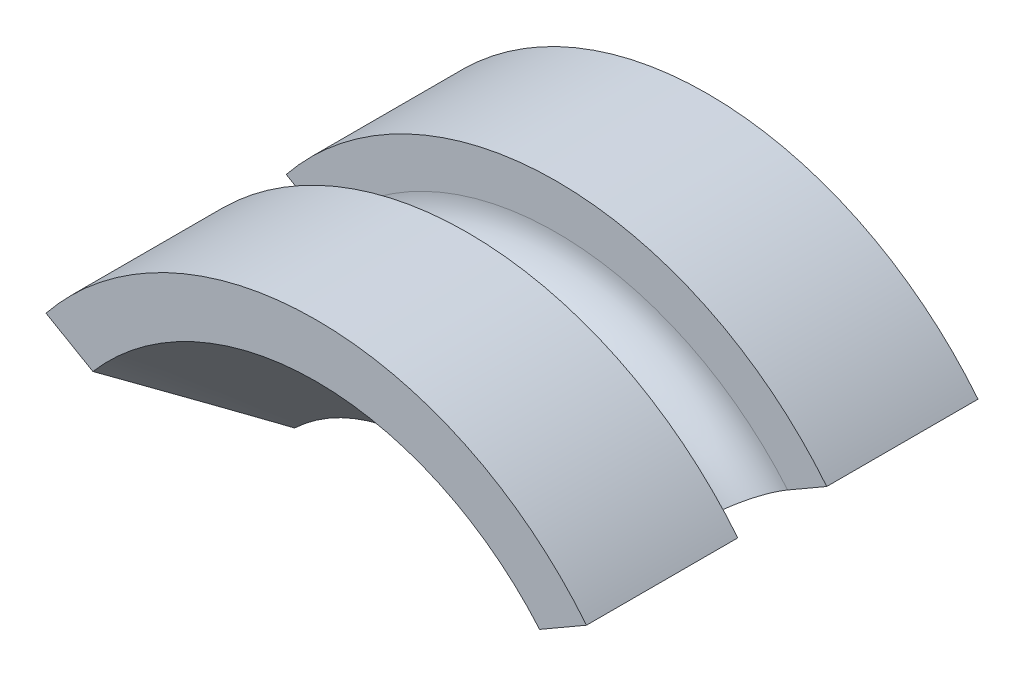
ISO-10303-21;
HEADER;
FILE_DESCRIPTION(('STEP AP214'),'2;1');
FILE_NAME('part.step','',(''),(''),'','','');
FILE_SCHEMA(('AUTOMOTIVE_DESIGN { 1 0 10303 214 1 1 1 1 }'));
ENDSEC;
DATA;
#1=APPLICATION_CONTEXT('core data for automotive mechanical design processes');
#2=APPLICATION_PROTOCOL_DEFINITION('international standard','automotive_design',2000,#1);
#3=PRODUCT_CONTEXT('',#1,'mechanical');
#4=PRODUCT('Part','Part','',(#3));
#5=PRODUCT_RELATED_PRODUCT_CATEGORY('part','',(#4));
#6=PRODUCT_DEFINITION_FORMATION('','',#4);
#7=PRODUCT_DEFINITION_CONTEXT('part definition',#1,'design');
#8=PRODUCT_DEFINITION('design','',#6,#7);
#9=PRODUCT_DEFINITION_SHAPE('','',#8);
#10=(LENGTH_UNIT() NAMED_UNIT(*) SI_UNIT(.MILLI.,.METRE.));
#11=(NAMED_UNIT(*) PLANE_ANGLE_UNIT() SI_UNIT($,.RADIAN.));
#12=(NAMED_UNIT(*) SI_UNIT($,.STERADIAN.) SOLID_ANGLE_UNIT());
#13=UNCERTAINTY_MEASURE_WITH_UNIT(LENGTH_MEASURE(1.E-05),#10,'distance_accuracy_value','');
#14=(GEOMETRIC_REPRESENTATION_CONTEXT(3) GLOBAL_UNCERTAINTY_ASSIGNED_CONTEXT((#13)) GLOBAL_UNIT_ASSIGNED_CONTEXT((#10,
#11,#12)) REPRESENTATION_CONTEXT('',''));
#15=CARTESIAN_POINT('',(0.,0.,0.));
#16=DIRECTION('',(0.,0.,1.));
#17=DIRECTION('',(1.,0.,0.));
#18=AXIS2_PLACEMENT_3D('',#15,#16,#17);
#19=CARTESIAN_POINT('',(0.,0.,0.));
#20=DIRECTION('',(0.,0.,-1.));
#21=DIRECTION('',(0.,1.,0.));
#22=AXIS2_PLACEMENT_3D('',#19,#20,#21);
#23=CYLINDRICAL_SURFACE('',#22,3.9);
#24=CARTESIAN_POINT('',(0.,0.,2.7));
#25=DIRECTION('',(0.,0.,-1.));
#26=DIRECTION('',(0.,1.,0.));
#27=AXIS2_PLACEMENT_3D('',#24,#25,#26);
#28=CIRCLE('',#27,3.9);
#29=CARTESIAN_POINT('',(-3.03728931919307,2.44640012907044,2.7));
#30=VERTEX_POINT('',#29);
#31=CARTESIAN_POINT('',(3.03728931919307,2.44640012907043,2.7));
#32=VERTEX_POINT('',#31);
#33=EDGE_CURVE('E109',#30,#32,#28,.T.);
#34=ORIENTED_EDGE('',*,*,#33,.F.);
#35=DIRECTION('',(0.,0.,-1.));
#36=VECTOR('',#35,1.);
#37=CARTESIAN_POINT('',(-3.03728931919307,2.44640012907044,4.4));
#38=LINE('',#37,#36);
#39=CARTESIAN_POINT('',(-3.03728931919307,2.44640012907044,4.4));
#40=VERTEX_POINT('',#39);
#41=EDGE_CURVE('E92',#40,#30,#38,.T.);
#42=ORIENTED_EDGE('',*,*,#41,.F.);
#43=CARTESIAN_POINT('',(0.,0.,4.4));
#44=DIRECTION('',(0.,0.,-1.));
#45=DIRECTION('',(0.,1.,0.));
#46=AXIS2_PLACEMENT_3D('',#43,#44,#45);
#47=CIRCLE('',#46,3.9);
#48=CARTESIAN_POINT('',(3.03728931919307,2.44640012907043,4.4));
#49=VERTEX_POINT('',#48);
#50=EDGE_CURVE('E107',#40,#49,#47,.T.);
#51=ORIENTED_EDGE('',*,*,#50,.T.);
#52=DIRECTION('',(0.,0.,-1.));
#53=VECTOR('',#52,1.);
#54=CARTESIAN_POINT('',(3.03728931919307,2.44640012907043,4.4));
#55=LINE('',#54,#53);
#56=EDGE_CURVE('E248',#49,#32,#55,.T.);
#57=ORIENTED_EDGE('',*,*,#56,.T.);
#58=EDGE_LOOP('',(#34,#42,#51,#57));
#59=FACE_BOUND('',#58,.T.);
#60=ADVANCED_FACE('F14',(#59),#23,.T.);
#61=CARTESIAN_POINT('',(0.,0.,4.4));
#62=DIRECTION('',(0.,0.,1.));
#63=DIRECTION('',(0.,-1.,0.));
#64=AXIS2_PLACEMENT_3D('',#61,#62,#63);
#65=CONICAL_SURFACE('',#64,3.3,0.785398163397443);
#66=CARTESIAN_POINT('',(0.,0.,4.4));
#67=DIRECTION('',(0.,0.,-1.));
#68=DIRECTION('',(0.,1.,0.));
#69=AXIS2_PLACEMENT_3D('',#66,#67,#68);
#70=CIRCLE('',#69,3.3);
#71=CARTESIAN_POINT('',(-2.51024909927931,2.14211331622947,4.4));
#72=VERTEX_POINT('',#71);
#73=CARTESIAN_POINT('',(2.51024909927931,2.14211331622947,4.4));
#74=VERTEX_POINT('',#73);
#75=EDGE_CURVE('E116',#72,#74,#70,.T.);
#76=ORIENTED_EDGE('',*,*,#75,.F.);
#77=CARTESIAN_POINT('',(-2.51042524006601,2.14221501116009,4.4002));
#78=CARTESIAN_POINT('',(-2.4218729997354,2.09108935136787,4.29965995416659));
#79=CARTESIAN_POINT('',(-2.33325892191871,2.03992798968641,4.1991923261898));
#80=CARTESIAN_POINT('',(-2.15584779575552,1.93749962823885,3.99847468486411));
#81=CARTESIAN_POINT('',(-2.0670507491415,1.88623262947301,3.89822466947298));
#82=CARTESIAN_POINT('',(-1.88921221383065,1.783557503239,3.69801256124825));
#83=CARTESIAN_POINT('',(-1.80017072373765,1.73214937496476,3.59805047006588));
#84=CARTESIAN_POINT('',(-1.62172129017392,1.62912154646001,3.39856157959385));
#85=CARTESIAN_POINT('',(-1.53231334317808,1.57750184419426,3.29903478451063));
#86=CARTESIAN_POINT('',(-1.44266176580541,1.52574148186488,3.1998));
#87=B_SPLINE_CURVE_WITH_KNOTS('',3,(#77,#78,#79,#80,#81,#82,#83,#84,#85,#86),.UNSPECIFIED.,.F.,
.F.,(4,2,2,2,4),(0.,0.43020090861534,0.8603977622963,1.29059707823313,1.72080054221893),.UNSPECIFIED.);
#88=CARTESIAN_POINT('',(-1.44284250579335,1.52584583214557,3.2));
#89=VERTEX_POINT('',#88);
#90=EDGE_CURVE('E95',#72,#89,#87,.T.);
#91=ORIENTED_EDGE('',*,*,#90,.T.);
#92=CARTESIAN_POINT('',(0.,0.,3.2));
#93=DIRECTION('',(0.,0.,-1.));
#94=DIRECTION('',(0.,1.,0.));
#95=AXIS2_PLACEMENT_3D('',#92,#93,#94);
#96=CIRCLE('',#95,2.1);
#97=CARTESIAN_POINT('',(1.44284250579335,1.52584583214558,3.2));
#98=VERTEX_POINT('',#97);
#99=EDGE_CURVE('E130',#89,#98,#96,.T.);
#100=ORIENTED_EDGE('',*,*,#99,.T.);
#101=CARTESIAN_POINT('',(1.44266176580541,1.52574148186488,3.1998));
#102=CARTESIAN_POINT('',(1.53231334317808,1.57750184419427,3.29903478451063));
#103=CARTESIAN_POINT('',(1.62172129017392,1.62912154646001,3.39856157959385));
#104=CARTESIAN_POINT('',(1.80017072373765,1.73214937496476,3.59805047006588));
#105=CARTESIAN_POINT('',(1.88921221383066,1.78355750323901,3.69801256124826));
#106=CARTESIAN_POINT('',(2.06705074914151,1.88623262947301,3.89822466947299));
#107=CARTESIAN_POINT('',(2.15584779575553,1.93749962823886,3.99847468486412));
#108=CARTESIAN_POINT('',(2.33325892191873,2.03992798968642,4.19919232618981));
#109=CARTESIAN_POINT('',(2.42187299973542,2.09108935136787,4.2996599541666));
#110=CARTESIAN_POINT('',(2.51042524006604,2.1422150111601,4.4002));
#111=B_SPLINE_CURVE_WITH_KNOTS('',3,(#101,#102,#103,#104,#105,#106,#107,#108,#109,#110),
.UNSPECIFIED.,.F.,.F.,(4,2,2,2,4),(0.,0.430203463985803,0.86040277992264,1.29059963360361,
1.72080054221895),.UNSPECIFIED.);
#112=EDGE_CURVE('E181',#98,#74,#111,.T.);
#113=ORIENTED_EDGE('',*,*,#112,.T.);
#114=EDGE_LOOP('',(#76,#91,#100,#113));
#115=FACE_BOUND('',#114,.T.);
#116=ADVANCED_FACE('F16',(#115),#65,.F.);
#117=CARTESIAN_POINT('',(0.,0.,0.));
#118=DIRECTION('',(0.,0.,-1.));
#119=DIRECTION('',(0.,1.,0.));
#120=AXIS2_PLACEMENT_3D('',#117,#118,#119);
#121=CYLINDRICAL_SURFACE('',#120,2.1);
#122=ORIENTED_EDGE('',*,*,#99,.F.);
#123=DIRECTION('',(0.,0.,-1.));
#124=VECTOR('',#123,1.);
#125=CARTESIAN_POINT('',(-1.44284250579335,1.52584583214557,4.4));
#126=LINE('',#125,#124);
#127=CARTESIAN_POINT('',(-1.44284250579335,1.52584583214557,1.20000000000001));
#128=VERTEX_POINT('',#127);
#129=EDGE_CURVE('E110',#89,#128,#126,.T.);
#130=ORIENTED_EDGE('',*,*,#129,.T.);
#131=CARTESIAN_POINT('',(0.,0.,1.20000000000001));
#132=DIRECTION('',(0.,0.,-1.));
#133=DIRECTION('',(0.,1.,0.));
#134=AXIS2_PLACEMENT_3D('',#131,#132,#133);
#135=CIRCLE('',#134,2.1);
#136=CARTESIAN_POINT('',(1.44284250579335,1.52584583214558,1.20000000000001));
#137=VERTEX_POINT('',#136);
#138=EDGE_CURVE('E127',#128,#137,#135,.T.);
#139=ORIENTED_EDGE('',*,*,#138,.T.);
#140=DIRECTION('',(0.,0.,-1.));
#141=VECTOR('',#140,1.);
#142=CARTESIAN_POINT('',(1.44284250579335,1.52584583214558,4.4));
#143=LINE('',#142,#141);
#144=EDGE_CURVE('E246',#98,#137,#143,.T.);
#145=ORIENTED_EDGE('',*,*,#144,.F.);
#146=EDGE_LOOP('',(#122,#130,#139,#145));
#147=FACE_BOUND('',#146,.T.);
#148=ADVANCED_FACE('F209',(#147),#121,.F.);
#149=CARTESIAN_POINT('',(0.,0.,1.20000000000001));
#150=DIRECTION('',(0.,0.,-1.));
#151=DIRECTION('',(0.,1.,0.));
#152=AXIS2_PLACEMENT_3D('',#149,#150,#151);
#153=CONICAL_SURFACE('',#152,2.1,0.785398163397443);
#154=ORIENTED_EDGE('',*,*,#138,.F.);
#155=CARTESIAN_POINT('',(-1.44266176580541,1.52574148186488,1.20020000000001));
#156=CARTESIAN_POINT('',(-1.53231334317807,1.57750184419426,1.10096521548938));
#157=CARTESIAN_POINT('',(-1.62172129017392,1.62912154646,1.00143842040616));
#158=CARTESIAN_POINT('',(-1.80017072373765,1.73214937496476,0.801949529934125));
#159=CARTESIAN_POINT('',(-1.88921221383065,1.783557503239,0.701987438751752));
#160=CARTESIAN_POINT('',(-2.0670507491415,1.88623262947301,0.501775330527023));
#161=CARTESIAN_POINT('',(-2.15584779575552,1.93749962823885,0.40152531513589));
#162=CARTESIAN_POINT('',(-2.33325892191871,2.03992798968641,0.200807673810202));
#163=CARTESIAN_POINT('',(-2.4218729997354,2.09108935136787,0.100340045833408));
#164=CARTESIAN_POINT('',(-2.51042524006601,2.14221501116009,-0.000199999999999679));
#165=B_SPLINE_CURVE_WITH_KNOTS('',3,(#155,#156,#157,#158,#159,#160,#161,#162,#163,#164),
.UNSPECIFIED.,.F.,.F.,(4,2,2,2,4),(0.,0.430203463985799,0.860402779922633,1.2905996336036,
1.72080054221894),.UNSPECIFIED.);
#166=CARTESIAN_POINT('',(-2.51024909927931,2.14211331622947,0.));
#167=VERTEX_POINT('',#166);
#168=EDGE_CURVE('E160',#128,#167,#165,.T.);
#169=ORIENTED_EDGE('',*,*,#168,.T.);
#170=CARTESIAN_POINT('',(0.,0.,0.));
#171=DIRECTION('',(0.,0.,-1.));
#172=DIRECTION('',(0.,1.,0.));
#173=AXIS2_PLACEMENT_3D('',#170,#171,#172);
#174=CIRCLE('',#173,3.3);
#175=CARTESIAN_POINT('',(2.51024909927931,2.14211331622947,0.));
#176=VERTEX_POINT('',#175);
#177=EDGE_CURVE('E119',#167,#176,#174,.T.);
#178=ORIENTED_EDGE('',*,*,#177,.T.);
#179=CARTESIAN_POINT('',(2.51042524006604,2.1422150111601,-0.000200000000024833));
#180=CARTESIAN_POINT('',(2.42187299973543,2.09108935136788,0.100340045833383));
#181=CARTESIAN_POINT('',(2.33325892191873,2.03992798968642,0.200807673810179));
#182=CARTESIAN_POINT('',(2.15584779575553,1.93749962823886,0.40152531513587));
#183=CARTESIAN_POINT('',(2.06705074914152,1.88623262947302,0.501775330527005));
#184=CARTESIAN_POINT('',(1.88921221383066,1.78355750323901,0.701987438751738));
#185=CARTESIAN_POINT('',(1.80017072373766,1.73214937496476,0.801949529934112));
#186=CARTESIAN_POINT('',(1.62172129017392,1.62912154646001,1.00143842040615));
#187=CARTESIAN_POINT('',(1.53231334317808,1.57750184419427,1.10096521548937));
#188=CARTESIAN_POINT('',(1.44266176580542,1.52574148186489,1.20020000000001));
#189=B_SPLINE_CURVE_WITH_KNOTS('',3,(#179,#180,#181,#182,#183,#184,#185,#186,#187,#188),
.UNSPECIFIED.,.F.,.F.,(4,2,2,2,4),(0.,0.430200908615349,0.860397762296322,1.29059707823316,
1.72080054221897),.UNSPECIFIED.);
#190=EDGE_CURVE('E198',#176,#137,#189,.T.);
#191=ORIENTED_EDGE('',*,*,#190,.T.);
#192=EDGE_LOOP('',(#154,#169,#178,#191));
#193=FACE_BOUND('',#192,.T.);
#194=ADVANCED_FACE('F204',(#193),#153,.F.);
#195=CARTESIAN_POINT('',(3.3,0.,0.));
#196=DIRECTION('',(0.,0.,-1.));
#197=DIRECTION('',(0.,1.,0.));
#198=AXIS2_PLACEMENT_3D('',#195,#196,#197);
#199=PLANE('',#198);
#200=ORIENTED_EDGE('',*,*,#177,.F.);
#201=DIRECTION('',(-0.86602540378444,0.5,0.));
#202=VECTOR('',#201,1.);
#203=CARTESIAN_POINT('',(-1.44284250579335,1.52584583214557,0.));
#204=LINE('',#203,#202);
#205=CARTESIAN_POINT('',(-3.03728931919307,2.44640012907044,0.));
#206=VERTEX_POINT('',#205);
#207=EDGE_CURVE('E240',#167,#206,#204,.T.);
#208=ORIENTED_EDGE('',*,*,#207,.T.);
#209=CARTESIAN_POINT('',(0.,0.,0.));
#210=DIRECTION('',(0.,0.,-1.));
#211=DIRECTION('',(0.,1.,0.));
#212=AXIS2_PLACEMENT_3D('',#209,#210,#211);
#213=CIRCLE('',#212,3.9);
#214=CARTESIAN_POINT('',(3.03728931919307,2.44640012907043,0.));
#215=VERTEX_POINT('',#214);
#216=EDGE_CURVE('E115',#206,#215,#213,.T.);
#217=ORIENTED_EDGE('',*,*,#216,.T.);
#218=DIRECTION('',(-0.866025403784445,-0.5,0.));
#219=VECTOR('',#218,1.);
#220=CARTESIAN_POINT('',(1.44284250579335,1.52584583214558,0.));
#221=LINE('',#220,#219);
#222=EDGE_CURVE('E101',#215,#176,#221,.T.);
#223=ORIENTED_EDGE('',*,*,#222,.T.);
#224=EDGE_LOOP('',(#200,#208,#217,#223));
#225=FACE_BOUND('',#224,.T.);
#226=ADVANCED_FACE('F208',(#225),#199,.T.);
#227=ORIENTED_EDGE('',*,*,#216,.F.);
#228=CARTESIAN_POINT('',(-3.03728931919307,2.44640012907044,1.7));
#229=VERTEX_POINT('',#228);
#230=EDGE_CURVE('E111',#229,#206,#38,.T.);
#231=ORIENTED_EDGE('',*,*,#230,.F.);
#232=CARTESIAN_POINT('',(0.,0.,1.7));
#233=DIRECTION('',(0.,0.,-1.));
#234=DIRECTION('',(0.,1.,0.));
#235=AXIS2_PLACEMENT_3D('',#232,#233,#234);
#236=CIRCLE('',#235,3.9);
#237=CARTESIAN_POINT('',(3.03728931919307,2.44640012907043,1.7));
#238=VERTEX_POINT('',#237);
#239=EDGE_CURVE('E149',#229,#238,#236,.T.);
#240=ORIENTED_EDGE('',*,*,#239,.T.);
#241=EDGE_CURVE('E37',#238,#215,#55,.T.);
#242=ORIENTED_EDGE('',*,*,#241,.T.);
#243=EDGE_LOOP('',(#227,#231,#240,#242));
#244=FACE_BOUND('',#243,.T.);
#245=ADVANCED_FACE('F223',(#244),#23,.T.);
#246=CARTESIAN_POINT('',(3.9,0.,4.4));
#247=DIRECTION('',(0.,0.,1.));
#248=DIRECTION('',(0.,-1.,0.));
#249=AXIS2_PLACEMENT_3D('',#246,#247,#248);
#250=PLANE('',#249);
#251=ORIENTED_EDGE('',*,*,#50,.F.);
#252=DIRECTION('',(-0.86602540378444,0.5,0.));
#253=VECTOR('',#252,1.);
#254=CARTESIAN_POINT('',(-1.44284250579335,1.52584583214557,4.4));
#255=LINE('',#254,#253);
#256=EDGE_CURVE('E89',#72,#40,#255,.T.);
#257=ORIENTED_EDGE('',*,*,#256,.F.);
#258=ORIENTED_EDGE('',*,*,#75,.T.);
#259=DIRECTION('',(-0.866025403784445,-0.5,0.));
#260=VECTOR('',#259,1.);
#261=CARTESIAN_POINT('',(1.44284250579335,1.52584583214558,4.4));
#262=LINE('',#261,#260);
#263=EDGE_CURVE('E100',#49,#74,#262,.T.);
#264=ORIENTED_EDGE('',*,*,#263,.F.);
#265=EDGE_LOOP('',(#251,#257,#258,#264));
#266=FACE_BOUND('',#265,.T.);
#267=ADVANCED_FACE('F114',(#266),#250,.T.);
#268=CARTESIAN_POINT('',(3.9,0.,2.7));
#269=DIRECTION('',(0.,0.,1.));
#270=DIRECTION('',(0.,-1.,0.));
#271=AXIS2_PLACEMENT_3D('',#268,#269,#270);
#272=PLANE('',#271);
#273=DIRECTION('',(0.86602540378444,-0.5,0.));
#274=VECTOR('',#273,1.);
#275=CARTESIAN_POINT('',(3.225,-1.169134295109,2.7));
#276=LINE('',#275,#274);
#277=CARTESIAN_POINT('',(-2.59827534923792,2.19293529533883,2.7));
#278=VERTEX_POINT('',#277);
#279=EDGE_CURVE('E180',#30,#278,#276,.T.);
#280=ORIENTED_EDGE('',*,*,#279,.F.);
#281=ORIENTED_EDGE('',*,*,#33,.T.);
#282=DIRECTION('',(0.866025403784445,0.5,0.));
#283=VECTOR('',#282,1.);
#284=CARTESIAN_POINT('',(2.625,2.20836477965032,2.7));
#285=LINE('',#284,#283);
#286=CARTESIAN_POINT('',(2.59827534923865,2.19293529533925,2.70000000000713));
#287=VERTEX_POINT('',#286);
#288=EDGE_CURVE('E146',#287,#32,#285,.T.);
#289=ORIENTED_EDGE('',*,*,#288,.F.);
#290=CARTESIAN_POINT('',(0.,0.,2.7));
#291=DIRECTION('',(0.,0.,-1.));
#292=DIRECTION('',(0.,1.,0.));
#293=AXIS2_PLACEMENT_3D('',#290,#291,#292);
#294=CIRCLE('',#293,3.4);
#295=EDGE_CURVE('E121',#278,#287,#294,.T.);
#296=ORIENTED_EDGE('',*,*,#295,.F.);
#297=EDGE_LOOP('',(#280,#281,#289,#296));
#298=FACE_BOUND('',#297,.T.);
#299=ADVANCED_FACE('F190',(#298),#272,.F.);
#300=CARTESIAN_POINT('',(0.,0.,2.2));
#301=DIRECTION('',(0.,0.,-1.));
#302=DIRECTION('',(0.,1.,0.));
#303=AXIS2_PLACEMENT_3D('',#300,#301,#302);
#304=TOROIDAL_SURFACE('',#303,3.4,0.5);
#305=CARTESIAN_POINT('',(-2.81541194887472,2.31829916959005,1.76530383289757));
#306=CARTESIAN_POINT('',(-2.83675637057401,2.33062237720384,1.77912218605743));
#307=CARTESIAN_POINT('',(-2.85711463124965,2.34237622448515,1.79501022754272));
#308=CARTESIAN_POINT('',(-2.89525736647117,2.36439794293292,1.83050909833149));
#309=CARTESIAN_POINT('',(-2.91303911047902,2.37466423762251,1.85012382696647));
#310=CARTESIAN_POINT('',(-2.94548969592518,2.39339959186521,1.89253678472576));
#311=CARTESIAN_POINT('',(-2.96015833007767,2.40186853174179,1.91533522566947));
#312=CARTESIAN_POINT('',(-2.98593371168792,2.41674995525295,1.96346841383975));
#313=CARTESIAN_POINT('',(-2.99704133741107,2.42316294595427,1.98880253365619));
#314=CARTESIAN_POINT('',(-3.01528006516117,2.43369308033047,2.04105565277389));
#315=CARTESIAN_POINT('',(-3.02244498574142,2.43782974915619,2.06795891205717));
#316=CARTESIAN_POINT('',(-3.03272767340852,2.44376646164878,2.12277830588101));
#317=CARTESIAN_POINT('',(-3.03584549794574,2.44556653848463,2.15069442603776));
#318=CARTESIAN_POINT('',(-3.03793041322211,2.44677026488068,2.20651593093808));
#319=CARTESIAN_POINT('',(-3.03692934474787,2.4461922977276,2.23441973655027));
#320=CARTESIAN_POINT('',(-3.03087886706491,2.44269905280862,2.28963520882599));
#321=CARTESIAN_POINT('',(-3.02582953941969,2.43978382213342,2.31694688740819));
#322=CARTESIAN_POINT('',(-3.01184290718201,2.43170863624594,2.3701734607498));
#323=CARTESIAN_POINT('',(-3.00291009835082,2.42655127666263,2.39608993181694));
#324=CARTESIAN_POINT('',(-2.98142346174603,2.41414596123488,2.44583659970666));
#325=CARTESIAN_POINT('',(-2.96886957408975,2.40689797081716,2.46966676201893));
#326=CARTESIAN_POINT('',(-2.94042912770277,2.39047787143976,2.51471360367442));
#327=CARTESIAN_POINT('',(-2.92452427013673,2.38129519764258,2.53591487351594));
#328=CARTESIAN_POINT('',(-2.88988777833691,2.36129780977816,2.57497401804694));
#329=CARTESIAN_POINT('',(-2.871156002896,2.35048301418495,2.59283172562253));
#330=CARTESIAN_POINT('',(-2.83118135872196,2.32740364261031,2.6249092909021));
#331=CARTESIAN_POINT('',(-2.80991328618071,2.31512451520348,2.63908726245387));
#332=CARTESIAN_POINT('',(-2.76563789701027,2.28956210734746,2.66318046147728));
#333=CARTESIAN_POINT('',(-2.7426304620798,2.27627875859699,2.673095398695));
#334=CARTESIAN_POINT('',(-2.69520548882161,2.24889793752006,2.6885173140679));
#335=CARTESIAN_POINT('',(-2.67077336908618,2.23479204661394,2.69396451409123));
#336=CARTESIAN_POINT('',(-2.62146487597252,2.20632377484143,2.70010090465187));
#337=CARTESIAN_POINT('',(-2.59658847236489,2.1919613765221,2.70078977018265));
#338=CARTESIAN_POINT('',(-2.5468118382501,2.16322282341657,2.69738447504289));
#339=CARTESIAN_POINT('',(-2.52191425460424,2.14884819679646,2.69323855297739));
#340=CARTESIAN_POINT('',(-2.47306971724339,2.12064779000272,2.68019538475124));
#341=CARTESIAN_POINT('',(-2.44912280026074,2.10682203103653,2.67129795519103));
#342=CARTESIAN_POINT('',(-2.40278886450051,2.08007112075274,2.64895478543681));
#343=CARTESIAN_POINT('',(-2.3804068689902,2.06714886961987,2.63549514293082));
#344=CARTESIAN_POINT('',(-2.3379385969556,2.04262980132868,2.60439332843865));
#345=CARTESIAN_POINT('',(-2.31785226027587,2.0310329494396,2.58675126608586));
#346=CARTESIAN_POINT('',(-2.28073956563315,2.00960592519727,2.54792815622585));
#347=CARTESIAN_POINT('',(-2.26368889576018,1.99976171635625,2.52677811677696));
#348=CARTESIAN_POINT('',(-2.23297294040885,1.98202785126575,2.48142004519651));
#349=CARTESIAN_POINT('',(-2.21930730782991,1.97413799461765,2.45721232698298));
#350=CARTESIAN_POINT('',(-2.19601939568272,1.9606927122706,2.4068940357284));
#351=CARTESIAN_POINT('',(-2.18632820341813,1.95509749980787,2.38082599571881));
#352=CARTESIAN_POINT('',(-2.17095605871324,1.94622238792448,2.32715854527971));
#353=CARTESIAN_POINT('',(-2.16527461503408,1.94294220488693,2.29955932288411));
#354=CARTESIAN_POINT('',(-2.15818038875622,1.93884635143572,2.24416823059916));
#355=CARTESIAN_POINT('',(-2.15668967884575,1.93798568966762,2.21638964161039));
#356=CARTESIAN_POINT('',(-2.15780270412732,1.93862829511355,2.16094312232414));
#357=CARTESIAN_POINT('',(-2.16040618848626,1.94013141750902,2.13327518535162));
#358=CARTESIAN_POINT('',(-2.16958573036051,1.94543122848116,2.07905281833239));
#359=CARTESIAN_POINT('',(-2.17613147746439,1.94921041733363,2.05249152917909));
#360=CARTESIAN_POINT('',(-2.19296045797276,1.95892663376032,2.00099890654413));
#361=CARTESIAN_POINT('',(-2.20324381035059,1.96486373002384,1.97606762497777));
#362=CARTESIAN_POINT('',(-2.22733193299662,1.9787710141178,1.9283075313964));
#363=CARTESIAN_POINT('',(-2.24116554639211,1.98675785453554,1.90549813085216));
#364=CARTESIAN_POINT('',(-2.27189611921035,2.00450015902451,1.86282151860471));
#365=CARTESIAN_POINT('',(-2.28879336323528,2.01425578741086,1.84295458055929));
#366=CARTESIAN_POINT('',(-2.32550766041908,2.03545279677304,1.80633003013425));
#367=CARTESIAN_POINT('',(-2.34537338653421,2.04692227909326,1.78963747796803));
#368=CARTESIAN_POINT('',(-2.38721426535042,2.07107912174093,1.76026049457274));
#369=CARTESIAN_POINT('',(-2.40918954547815,2.08376655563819,1.7475763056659));
#370=CARTESIAN_POINT('',(-2.45504872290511,2.11024336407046,1.72634966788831));
#371=CARTESIAN_POINT('',(-2.47895964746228,2.12404834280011,1.71788502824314));
#372=CARTESIAN_POINT('',(-2.52767470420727,2.15217399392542,1.70566437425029));
#373=CARTESIAN_POINT('',(-2.55247910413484,2.16649482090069,1.70190978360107));
#374=CARTESIAN_POINT('',(-2.60250879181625,2.19537947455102,1.69920633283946));
#375=CARTESIAN_POINT('',(-2.62773585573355,2.20994432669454,1.70030149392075));
#376=CARTESIAN_POINT('',(-2.67764962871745,2.23876205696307,1.70738318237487));
#377=CARTESIAN_POINT('',(-2.70233694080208,2.2530152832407,1.7133639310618));
#378=CARTESIAN_POINT('',(-2.74186406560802,2.2758362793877,1.72706602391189));
#379=CARTESIAN_POINT('',(-2.75707393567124,2.28461770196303,1.73340441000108));
#380=CARTESIAN_POINT('',(-2.78680308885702,2.30178183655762,1.74796252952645));
#381=CARTESIAN_POINT('',(-2.80132237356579,2.31016454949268,1.75618225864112));
#382=CARTESIAN_POINT('',(-2.81541194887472,2.31829916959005,1.76530383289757));
#383=B_SPLINE_CURVE_WITH_KNOTS('',3,(#305,#306,#307,#308,#309,#310,#311,#312,#313,#314,#315,
#316,#317,#318,#319,#320,#321,#322,#323,#324,#325,#326,#327,#328,#329,#330,#331,#332,#333,#334,
#335,#336,#337,#338,#339,#340,#341,#342,#343,#344,#345,#346,#347,#348,#349,#350,#351,#352,#353,
#354,#355,#356,#357,#358,#359,#360,#361,#362,#363,#364,#365,#366,#367,#368,#369,#370,#371,#372,
#373,#374,#375,#376,#377,#378,#379,#380,#381,#382),.UNSPECIFIED.,.T.,.F.,(4,2,2,2,2,2,2,2,2,2,2,
2,2,2,2,2,2,2,2,2,2,2,2,2,2,2,2,2,2,2,2,2,2,2,2,2,2,2,4),(0.,0.0847006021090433,
0.169490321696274,0.254285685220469,0.339060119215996,0.423095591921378,0.507129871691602,
0.590515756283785,0.673899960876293,0.757187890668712,0.840477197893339,0.924233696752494,
1.00799438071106,1.09267038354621,1.17735215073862,1.26314927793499,1.34895226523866,
1.43568236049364,1.52241580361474,1.6094159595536,1.69641383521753,1.78268011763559,
1.86893755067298,1.95362874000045,2.03830955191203,2.12140495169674,2.20449526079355,
2.28695473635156,2.36941683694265,2.45257134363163,2.53573357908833,2.62045026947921,
2.7051720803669,2.79140318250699,2.87766034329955,2.96470205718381,3.05164096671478,
3.10755244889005,3.16346380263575),.UNSPECIFIED.);
#384=CARTESIAN_POINT('',(-2.59827534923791,2.19293529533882,1.7));
#385=VERTEX_POINT('',#384);
#386=EDGE_CURVE('E29',#278,#385,#383,.T.);
#387=ORIENTED_EDGE('',*,*,#386,.F.);
#388=ORIENTED_EDGE('',*,*,#295,.T.);
#389=CARTESIAN_POINT('',(2.24692257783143,1.99008167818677,1.89799190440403));
#390=CARTESIAN_POINT('',(2.2321883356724,1.98157485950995,1.91998936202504));
#391=CARTESIAN_POINT('',(2.2190307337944,1.9739783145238,1.94341742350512));
#392=CARTESIAN_POINT('',(2.1962840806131,1.96084552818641,1.99250215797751));
#393=CARTESIAN_POINT('',(2.18669847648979,1.95531127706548,2.01816095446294));
#394=CARTESIAN_POINT('',(2.17141113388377,1.94648512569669,2.07098788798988));
#395=CARTESIAN_POINT('',(2.16571024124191,1.94319371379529,2.09815635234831));
#396=CARTESIAN_POINT('',(2.15838648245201,1.93896533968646,2.15321055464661));
#397=CARTESIAN_POINT('',(2.1567626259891,1.93802780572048,2.18109611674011));
#398=CARTESIAN_POINT('',(2.1576394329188,1.93853403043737,2.23650609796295));
#399=CARTESIAN_POINT('',(2.16009982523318,1.93995453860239,2.26403137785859));
#400=CARTESIAN_POINT('',(2.16898812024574,1.94508619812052,2.31821365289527));
#401=CARTESIAN_POINT('',(2.17541609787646,1.94879739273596,2.34487063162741));
#402=CARTESIAN_POINT('',(2.19203504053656,1.95839234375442,2.39657663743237));
#403=CARTESIAN_POINT('',(2.2022268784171,1.96427660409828,2.4216252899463));
#404=CARTESIAN_POINT('',(2.22605719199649,1.97803504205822,2.46943038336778));
#405=CARTESIAN_POINT('',(2.2396958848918,1.98590934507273,2.49218667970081));
#406=CARTESIAN_POINT('',(2.27023711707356,2.00354233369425,2.535124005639));
#407=CARTESIAN_POINT('',(2.28718441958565,2.01332686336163,2.55526256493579));
#408=CARTESIAN_POINT('',(2.32371629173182,2.03441854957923,2.59204657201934));
#409=CARTESIAN_POINT('',(2.34330112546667,2.04572585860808,2.60869166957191));
#410=CARTESIAN_POINT('',(2.38496700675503,2.06978166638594,2.63835825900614));
#411=CARTESIAN_POINT('',(2.40708961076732,2.08255415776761,2.65130195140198));
#412=CARTESIAN_POINT('',(2.45288435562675,2.10899376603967,2.67278618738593));
#413=CARTESIAN_POINT('',(2.47655662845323,2.12266095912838,2.68132635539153));
#414=CARTESIAN_POINT('',(2.52513871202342,2.15070983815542,2.69386847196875));
#415=CARTESIAN_POINT('',(2.55006127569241,2.1650988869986,2.69780465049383));
#416=CARTESIAN_POINT('',(2.60012612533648,2.19400384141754,2.7008063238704));
#417=CARTESIAN_POINT('',(2.62526841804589,2.20851975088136,2.69987166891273));
#418=CARTESIAN_POINT('',(2.67513600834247,2.23731081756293,2.69313357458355));
#419=CARTESIAN_POINT('',(2.69985984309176,2.25158513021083,2.68731566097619));
#420=CARTESIAN_POINT('',(2.74809982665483,2.27943649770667,2.67093447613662));
#421=CARTESIAN_POINT('',(2.77161600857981,2.29301357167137,2.6603713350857));
#422=CARTESIAN_POINT('',(2.81658516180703,2.31897652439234,2.6348702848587));
#423=CARTESIAN_POINT('',(2.83805188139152,2.33137034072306,2.61996471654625));
#424=CARTESIAN_POINT('',(2.87847659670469,2.35470956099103,2.5861531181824));
#425=CARTESIAN_POINT('',(2.89743475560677,2.3656550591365,2.56724734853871));
#426=CARTESIAN_POINT('',(2.93204591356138,2.38563782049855,2.52622780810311));
#427=CARTESIAN_POINT('',(2.94773780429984,2.39469753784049,2.50415779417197));
#428=CARTESIAN_POINT('',(2.97564077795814,2.4108073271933,2.4572562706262));
#429=CARTESIAN_POINT('',(2.98785211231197,2.41785754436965,2.43242496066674));
#430=CARTESIAN_POINT('',(3.0082878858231,2.4296561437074,2.38104519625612));
#431=CARTESIAN_POINT('',(3.01656087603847,2.43443255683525,2.35452248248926));
#432=CARTESIAN_POINT('',(3.02909580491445,2.44166960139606,2.30024217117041));
#433=CARTESIAN_POINT('',(3.03335796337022,2.44413035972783,2.27248464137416));
#434=CARTESIAN_POINT('',(3.03772210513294,2.44664999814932,2.21677612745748));
#435=CARTESIAN_POINT('',(3.03785921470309,2.44672915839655,2.18882880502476));
#436=CARTESIAN_POINT('',(3.0340584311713,2.44453477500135,2.13330662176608));
#437=CARTESIAN_POINT('',(3.03012062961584,2.44226128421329,2.10573175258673));
#438=CARTESIAN_POINT('',(3.01830177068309,2.43543766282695,2.05179596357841));
#439=CARTESIAN_POINT('',(3.01042908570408,2.43089236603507,2.02543259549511));
#440=CARTESIAN_POINT('',(2.99097982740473,2.41966333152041,1.97459615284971));
#441=CARTESIAN_POINT('',(2.97940320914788,2.41297956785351,1.95012310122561));
#442=CARTESIAN_POINT('',(2.95282418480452,2.39763416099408,1.90363225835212));
#443=CARTESIAN_POINT('',(2.93780587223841,2.38896333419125,1.88162659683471));
#444=CARTESIAN_POINT('',(2.90481278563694,2.3699147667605,1.84080210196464));
#445=CARTESIAN_POINT('',(2.88683787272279,2.35953694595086,1.82198341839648));
#446=CARTESIAN_POINT('',(2.8482466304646,2.33725628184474,1.78785471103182));
#447=CARTESIAN_POINT('',(2.82760492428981,2.32533878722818,1.77258295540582));
#448=CARTESIAN_POINT('',(2.78441660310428,2.30040399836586,1.74619792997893));
#449=CARTESIAN_POINT('',(2.76186985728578,2.28738662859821,1.73508494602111));
#450=CARTESIAN_POINT('',(2.715195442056,2.26043914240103,1.71717924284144));
#451=CARTESIAN_POINT('',(2.69105091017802,2.24649929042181,1.71044512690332));
#452=CARTESIAN_POINT('',(2.64212980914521,2.21825467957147,1.70169482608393));
#453=CARTESIAN_POINT('',(2.61735321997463,2.20394990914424,1.69967879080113));
#454=CARTESIAN_POINT('',(2.56757082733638,2.17520803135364,1.70040846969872));
#455=CARTESIAN_POINT('',(2.54256561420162,2.16077126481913,1.70320849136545));
#456=CARTESIAN_POINT('',(2.49330430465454,2.13233023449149,1.71359407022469));
#457=CARTESIAN_POINT('',(2.4690484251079,2.11832609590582,1.72118099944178));
#458=CARTESIAN_POINT('',(2.42186372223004,2.09108399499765,1.74098408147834));
#459=CARTESIAN_POINT('',(2.39894201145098,2.07785013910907,1.75322281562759));
#460=CARTESIAN_POINT('',(2.35523966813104,2.05261857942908,1.78199200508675));
#461=CARTESIAN_POINT('',(2.33445651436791,2.04061942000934,1.79851732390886));
#462=CARTESIAN_POINT('',(2.30243584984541,2.02213228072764,1.82893969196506));
#463=CARTESIAN_POINT('',(2.29040132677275,2.01518414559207,1.8417358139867));
#464=CARTESIAN_POINT('',(2.26764344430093,2.00204487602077,1.86879905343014));
#465=CARTESIAN_POINT('',(2.25692007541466,1.99585373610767,1.88306616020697));
#466=CARTESIAN_POINT('',(2.24692257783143,1.99008167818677,1.89799190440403));
#467=B_SPLINE_CURVE_WITH_KNOTS('',3,(#389,#390,#391,#392,#393,#394,#395,#396,#397,#398,#399,
#400,#401,#402,#403,#404,#405,#406,#407,#408,#409,#410,#411,#412,#413,#414,#415,#416,#417,#418,
#419,#420,#421,#422,#423,#424,#425,#426,#427,#428,#429,#430,#431,#432,#433,#434,#435,#436,#437,
#438,#439,#440,#441,#442,#443,#444,#445,#446,#447,#448,#449,#450,#451,#452,#453,#454,#455,#456,
#457,#458,#459,#460,#461,#462,#463,#464,#465,#466),.UNSPECIFIED.,.T.,.F.,(4,2,2,2,2,2,2,2,2,2,2,
2,2,2,2,2,2,2,2,2,2,2,2,2,2,2,2,2,2,2,2,2,2,2,2,2,2,2,4),(0.,0.0833603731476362,
0.166800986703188,0.250259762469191,0.333698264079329,0.416318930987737,0.498941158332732,
0.581582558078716,0.664229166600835,0.748082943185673,0.831945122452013,0.917458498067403,
1.00297916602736,1.0897071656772,1.17643783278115,1.26342648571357,1.35041275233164,
1.43676705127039,1.52311573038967,1.60836857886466,1.69361526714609,1.77778194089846,
1.86194400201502,1.94538918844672,2.02883250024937,2.11209901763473,2.19536654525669,
2.27902696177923,2.36269130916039,2.44722024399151,2.53175498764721,2.61739898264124,
2.70304569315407,2.78966452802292,2.87630820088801,2.96337795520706,3.05034385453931,
3.10690605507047,3.16346784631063),.UNSPECIFIED.);
#468=CARTESIAN_POINT('',(2.59827534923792,2.19293529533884,1.7));
#469=VERTEX_POINT('',#468);
#470=EDGE_CURVE('E134',#469,#287,#467,.T.);
#471=ORIENTED_EDGE('',*,*,#470,.F.);
#472=CARTESIAN_POINT('',(0.,0.,1.7));
#473=DIRECTION('',(0.,0.,-1.));
#474=DIRECTION('',(0.,1.,0.));
#475=AXIS2_PLACEMENT_3D('',#472,#473,#474);
#476=CIRCLE('',#475,3.4);
#477=EDGE_CURVE('E144',#385,#469,#476,.T.);
#478=ORIENTED_EDGE('',*,*,#477,.F.);
#479=EDGE_LOOP('',(#387,#388,#471,#478));
#480=FACE_BOUND('',#479,.T.);
#481=ADVANCED_FACE('F143',(#480),#304,.F.);
#482=CARTESIAN_POINT('',(3.9,0.,1.7));
#483=DIRECTION('',(0.,0.,-1.));
#484=DIRECTION('',(0.,1.,0.));
#485=AXIS2_PLACEMENT_3D('',#482,#483,#484);
#486=PLANE('',#485);
#487=DIRECTION('',(-0.86602540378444,0.5,0.));
#488=VECTOR('',#487,1.);
#489=CARTESIAN_POINT('',(3.225,-1.169134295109,1.7));
#490=LINE('',#489,#488);
#491=EDGE_CURVE('E9',#385,#229,#490,.T.);
#492=ORIENTED_EDGE('',*,*,#491,.F.);
#493=ORIENTED_EDGE('',*,*,#477,.T.);
#494=DIRECTION('',(-0.866025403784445,-0.5,0.));
#495=VECTOR('',#494,1.);
#496=CARTESIAN_POINT('',(2.625,2.20836477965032,1.7));
#497=LINE('',#496,#495);
#498=EDGE_CURVE('E23',#238,#469,#497,.T.);
#499=ORIENTED_EDGE('',*,*,#498,.F.);
#500=ORIENTED_EDGE('',*,*,#239,.F.);
#501=EDGE_LOOP('',(#492,#493,#499,#500));
#502=FACE_BOUND('',#501,.T.);
#503=ADVANCED_FACE('F148',(#502),#486,.F.);
#504=CARTESIAN_POINT('',(1.44284250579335,1.52584583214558,4.4));
#505=DIRECTION('',(0.5,-0.866025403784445,0.));
#506=DIRECTION('',(0.866025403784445,0.5,0.));
#507=AXIS2_PLACEMENT_3D('',#504,#505,#506);
#508=PLANE('',#507);
#509=ORIENTED_EDGE('',*,*,#144,.T.);
#510=ORIENTED_EDGE('',*,*,#190,.F.);
#511=ORIENTED_EDGE('',*,*,#222,.F.);
#512=ORIENTED_EDGE('',*,*,#241,.F.);
#513=ORIENTED_EDGE('',*,*,#498,.T.);
#514=ORIENTED_EDGE('',*,*,#470,.T.);
#515=ORIENTED_EDGE('',*,*,#288,.T.);
#516=ORIENTED_EDGE('',*,*,#56,.F.);
#517=ORIENTED_EDGE('',*,*,#263,.T.);
#518=ORIENTED_EDGE('',*,*,#112,.F.);
#519=EDGE_LOOP('',(#509,#510,#511,#512,#513,#514,#515,#516,#517,#518));
#520=FACE_BOUND('',#519,.T.);
#521=ADVANCED_FACE('F133',(#520),#508,.T.);
#522=CARTESIAN_POINT('',(-1.44284250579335,1.52584583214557,4.4));
#523=DIRECTION('',(-0.5,-0.86602540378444,0.));
#524=DIRECTION('',(0.86602540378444,-0.5,0.));
#525=AXIS2_PLACEMENT_3D('',#522,#523,#524);
#526=PLANE('',#525);
#527=ORIENTED_EDGE('',*,*,#256,.T.);
#528=ORIENTED_EDGE('',*,*,#41,.T.);
#529=ORIENTED_EDGE('',*,*,#279,.T.);
#530=ORIENTED_EDGE('',*,*,#386,.T.);
#531=ORIENTED_EDGE('',*,*,#491,.T.);
#532=ORIENTED_EDGE('',*,*,#230,.T.);
#533=ORIENTED_EDGE('',*,*,#207,.F.);
#534=ORIENTED_EDGE('',*,*,#168,.F.);
#535=ORIENTED_EDGE('',*,*,#129,.F.);
#536=ORIENTED_EDGE('',*,*,#90,.F.);
#537=EDGE_LOOP('',(#527,#528,#529,#530,#531,#532,#533,#534,#535,#536));
#538=FACE_BOUND('',#537,.T.);
#539=ADVANCED_FACE('F91',(#538),#526,.T.);
#540=CLOSED_SHELL('',(#60,#116,#148,#194,#226,#245,#267,#299,#481,#503,#521,#539));
#541=MANIFOLD_SOLID_BREP('B1',#540);
#542=ADVANCED_BREP_SHAPE_REPRESENTATION('',(#18,#541),#14);
#543=SHAPE_DEFINITION_REPRESENTATION(#9,#542);
ENDSEC;
END-ISO-10303-21;
